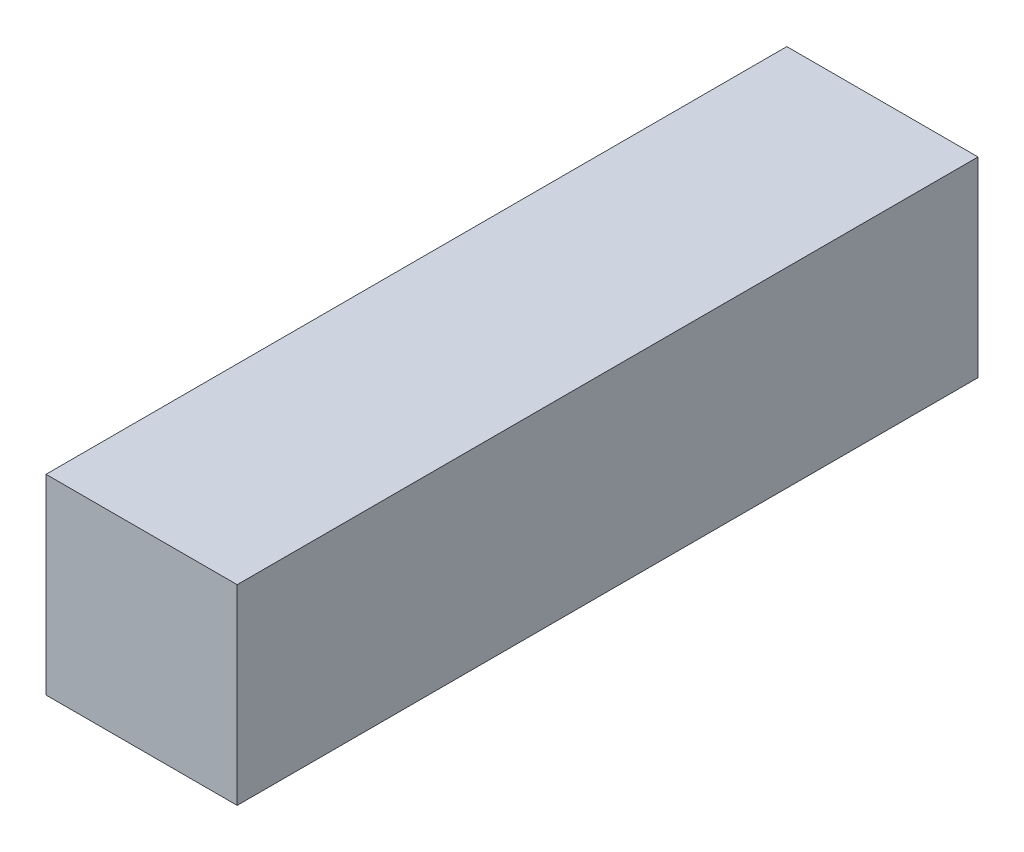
ISO-10303-21;
HEADER;
FILE_DESCRIPTION(('STEP AP214'),'2;1');
FILE_NAME('part.step','',(''),(''),'','','');
FILE_SCHEMA(('AUTOMOTIVE_DESIGN { 1 0 10303 214 1 1 1 1 }'));
ENDSEC;
DATA;
#1=APPLICATION_CONTEXT('core data for automotive mechanical design processes');
#2=APPLICATION_PROTOCOL_DEFINITION('international standard','automotive_design',2000,#1);
#3=PRODUCT_CONTEXT('',#1,'mechanical');
#4=PRODUCT('Part','Part','',(#3));
#5=PRODUCT_RELATED_PRODUCT_CATEGORY('part','',(#4));
#6=PRODUCT_DEFINITION_FORMATION('','',#4);
#7=PRODUCT_DEFINITION_CONTEXT('part definition',#1,'design');
#8=PRODUCT_DEFINITION('design','',#6,#7);
#9=PRODUCT_DEFINITION_SHAPE('','',#8);
#10=(LENGTH_UNIT() NAMED_UNIT(*) SI_UNIT(.MILLI.,.METRE.));
#11=(NAMED_UNIT(*) PLANE_ANGLE_UNIT() SI_UNIT($,.RADIAN.));
#12=(NAMED_UNIT(*) SI_UNIT($,.STERADIAN.) SOLID_ANGLE_UNIT());
#13=UNCERTAINTY_MEASURE_WITH_UNIT(LENGTH_MEASURE(1.E-05),#10,'distance_accuracy_value','');
#14=(GEOMETRIC_REPRESENTATION_CONTEXT(3) GLOBAL_UNCERTAINTY_ASSIGNED_CONTEXT((#13)) GLOBAL_UNIT_ASSIGNED_CONTEXT((#10,
#11,#12)) REPRESENTATION_CONTEXT('',''));
#15=CARTESIAN_POINT('',(0.,0.,0.));
#16=DIRECTION('',(0.,0.,1.));
#17=DIRECTION('',(1.,0.,0.));
#18=AXIS2_PLACEMENT_3D('',#15,#16,#17);
#19=CARTESIAN_POINT('',(-2.00000000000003,3.,-7.25));
#20=DIRECTION('',(1.,0.,0.));
#21=DIRECTION('',(0.,0.,-1.));
#22=AXIS2_PLACEMENT_3D('',#19,#20,#21);
#23=PLANE('',#22);
#24=DIRECTION('',(0.,0.,1.));
#25=VECTOR('',#24,1.);
#26=CARTESIAN_POINT('',(-2.00000000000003,0.,-7.25));
#27=LINE('',#26,#25);
#28=CARTESIAN_POINT('',(-2.00000000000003,0.,-7.25));
#29=VERTEX_POINT('',#28);
#30=CARTESIAN_POINT('',(-2.00000000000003,0.,8.25000000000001));
#31=VERTEX_POINT('',#30);
#32=EDGE_CURVE('E154',#29,#31,#27,.T.);
#33=ORIENTED_EDGE('',*,*,#32,.T.);
#34=DIRECTION('',(0.,-1.,0.));
#35=VECTOR('',#34,1.);
#36=CARTESIAN_POINT('',(-2.00000000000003,3.,8.25000000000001));
#37=LINE('',#36,#35);
#38=CARTESIAN_POINT('',(-2.00000000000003,4.,8.25000000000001));
#39=VERTEX_POINT('',#38);
#40=EDGE_CURVE('E168',#39,#31,#37,.T.);
#41=ORIENTED_EDGE('',*,*,#40,.F.);
#42=DIRECTION('',(0.,0.,1.));
#43=VECTOR('',#42,1.);
#44=CARTESIAN_POINT('',(-2.00000000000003,4.,8.25000000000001));
#45=LINE('',#44,#43);
#46=CARTESIAN_POINT('',(-2.00000000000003,4.,-7.25));
#47=VERTEX_POINT('',#46);
#48=EDGE_CURVE('E137',#47,#39,#45,.T.);
#49=ORIENTED_EDGE('',*,*,#48,.F.);
#50=DIRECTION('',(0.,-1.,0.));
#51=VECTOR('',#50,1.);
#52=CARTESIAN_POINT('',(-2.00000000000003,3.,-7.25));
#53=LINE('',#52,#51);
#54=EDGE_CURVE('E171',#47,#29,#53,.T.);
#55=ORIENTED_EDGE('',*,*,#54,.T.);
#56=EDGE_LOOP('',(#33,#41,#49,#55));
#57=FACE_BOUND('',#56,.T.);
#58=ADVANCED_FACE('F33',(#57),#23,.F.);
#59=CARTESIAN_POINT('',(2.00000000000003,3.,8.25000000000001));
#60=DIRECTION('',(0.,0.,-1.));
#61=DIRECTION('',(-1.,0.,0.));
#62=AXIS2_PLACEMENT_3D('',#59,#60,#61);
#63=PLANE('',#62);
#64=DIRECTION('',(1.,0.,0.));
#65=VECTOR('',#64,1.);
#66=CARTESIAN_POINT('',(2.00000000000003,0.,8.25000000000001));
#67=LINE('',#66,#65);
#68=CARTESIAN_POINT('',(2.00000000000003,0.,8.25000000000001));
#69=VERTEX_POINT('',#68);
#70=EDGE_CURVE('E157',#31,#69,#67,.T.);
#71=ORIENTED_EDGE('',*,*,#70,.T.);
#72=DIRECTION('',(0.,-1.,0.));
#73=VECTOR('',#72,1.);
#74=CARTESIAN_POINT('',(2.00000000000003,3.,8.25000000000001));
#75=LINE('',#74,#73);
#76=CARTESIAN_POINT('',(2.00000000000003,4.,8.25000000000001));
#77=VERTEX_POINT('',#76);
#78=EDGE_CURVE('E166',#77,#69,#75,.T.);
#79=ORIENTED_EDGE('',*,*,#78,.F.);
#80=DIRECTION('',(1.,0.,0.));
#81=VECTOR('',#80,1.);
#82=CARTESIAN_POINT('',(2.00000000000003,4.,8.25000000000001));
#83=LINE('',#82,#81);
#84=EDGE_CURVE('E140',#39,#77,#83,.T.);
#85=ORIENTED_EDGE('',*,*,#84,.F.);
#86=ORIENTED_EDGE('',*,*,#40,.T.);
#87=EDGE_LOOP('',(#71,#79,#85,#86));
#88=FACE_BOUND('',#87,.T.);
#89=ADVANCED_FACE('F194',(#88),#63,.F.);
#90=CARTESIAN_POINT('',(2.00000000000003,3.,7.25));
#91=DIRECTION('',(-1.,0.,0.));
#92=DIRECTION('',(0.,0.,1.));
#93=AXIS2_PLACEMENT_3D('',#90,#91,#92);
#94=PLANE('',#93);
#95=DIRECTION('',(0.,0.,-1.));
#96=VECTOR('',#95,1.);
#97=CARTESIAN_POINT('',(2.00000000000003,0.,7.25));
#98=LINE('',#97,#96);
#99=CARTESIAN_POINT('',(2.00000000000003,0.,-7.25));
#100=VERTEX_POINT('',#99);
#101=EDGE_CURVE('E55',#69,#100,#98,.T.);
#102=ORIENTED_EDGE('',*,*,#101,.T.);
#103=DIRECTION('',(0.,-1.,0.));
#104=VECTOR('',#103,1.);
#105=CARTESIAN_POINT('',(2.00000000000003,3.,-7.25));
#106=LINE('',#105,#104);
#107=CARTESIAN_POINT('',(2.00000000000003,4.,-7.25));
#108=VERTEX_POINT('',#107);
#109=EDGE_CURVE('E164',#108,#100,#106,.T.);
#110=ORIENTED_EDGE('',*,*,#109,.F.);
#111=DIRECTION('',(0.,0.,-1.));
#112=VECTOR('',#111,1.);
#113=CARTESIAN_POINT('',(2.00000000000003,4.,-7.25));
#114=LINE('',#113,#112);
#115=EDGE_CURVE('E143',#77,#108,#114,.T.);
#116=ORIENTED_EDGE('',*,*,#115,.F.);
#117=ORIENTED_EDGE('',*,*,#78,.T.);
#118=EDGE_LOOP('',(#102,#110,#116,#117));
#119=FACE_BOUND('',#118,.T.);
#120=ADVANCED_FACE('F199',(#119),#94,.F.);
#121=CARTESIAN_POINT('',(1.00000000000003,3.,-7.25));
#122=DIRECTION('',(0.,0.,1.));
#123=DIRECTION('',(1.,0.,0.));
#124=AXIS2_PLACEMENT_3D('',#121,#122,#123);
#125=PLANE('',#124);
#126=DIRECTION('',(-1.,0.,0.));
#127=VECTOR('',#126,1.);
#128=CARTESIAN_POINT('',(-2.00000000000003,3.,-7.25));
#129=LINE('',#128,#127);
#130=CARTESIAN_POINT('',(1.58749999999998,2.99999999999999,-7.25));
#131=VERTEX_POINT('',#130);
#132=CARTESIAN_POINT('',(-1.5875,2.99999999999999,-7.25));
#133=VERTEX_POINT('',#132);
#134=EDGE_CURVE('E111',#131,#133,#129,.T.);
#135=ORIENTED_EDGE('',*,*,#134,.T.);
#136=DIRECTION('',(0.,-1.,0.));
#137=VECTOR('',#136,1.);
#138=CARTESIAN_POINT('',(-1.58750000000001,3.,-7.25));
#139=LINE('',#138,#137);
#140=CARTESIAN_POINT('',(-1.58750000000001,0.,-7.25));
#141=VERTEX_POINT('',#140);
#142=EDGE_CURVE('E131',#133,#141,#139,.T.);
#143=ORIENTED_EDGE('',*,*,#142,.T.);
#144=DIRECTION('',(-1.,0.,0.));
#145=VECTOR('',#144,1.);
#146=CARTESIAN_POINT('',(-2.00000000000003,0.,-7.25));
#147=LINE('',#146,#145);
#148=EDGE_CURVE('E149',#141,#29,#147,.T.);
#149=ORIENTED_EDGE('',*,*,#148,.T.);
#150=ORIENTED_EDGE('',*,*,#54,.F.);
#151=DIRECTION('',(-1.,0.,0.));
#152=VECTOR('',#151,1.);
#153=CARTESIAN_POINT('',(-2.00000000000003,4.,-7.25));
#154=LINE('',#153,#152);
#155=EDGE_CURVE('E146',#108,#47,#154,.T.);
#156=ORIENTED_EDGE('',*,*,#155,.F.);
#157=ORIENTED_EDGE('',*,*,#109,.T.);
#158=DIRECTION('',(-1.,0.,0.));
#159=VECTOR('',#158,1.);
#160=CARTESIAN_POINT('',(1.00000000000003,0.,-7.25));
#161=LINE('',#160,#159);
#162=CARTESIAN_POINT('',(1.58749999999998,0.,-7.25));
#163=VERTEX_POINT('',#162);
#164=EDGE_CURVE('E161',#100,#163,#161,.T.);
#165=ORIENTED_EDGE('',*,*,#164,.T.);
#166=DIRECTION('',(0.,1.,0.));
#167=VECTOR('',#166,1.);
#168=CARTESIAN_POINT('',(1.58749999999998,3.,-7.25));
#169=LINE('',#168,#167);
#170=EDGE_CURVE('E135',#163,#131,#169,.T.);
#171=ORIENTED_EDGE('',*,*,#170,.T.);
#172=EDGE_LOOP('',(#135,#143,#149,#150,#156,#157,#165,#171));
#173=FACE_BOUND('',#172,.T.);
#174=ADVANCED_FACE('F188',(#173),#125,.F.);
#175=CARTESIAN_POINT('',(-0.99999999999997,0.,7.25000000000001));
#176=DIRECTION('',(0.,1.,0.));
#177=DIRECTION('',(0.,0.,1.));
#178=AXIS2_PLACEMENT_3D('',#175,#176,#177);
#179=PLANE('',#178);
#180=DIRECTION('',(-0.0290774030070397,0.,-0.999577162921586));
#181=VECTOR('',#180,1.);
#182=CARTESIAN_POINT('',(1.5717330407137,0.,7.17518904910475));
#183=LINE('',#182,#181);
#184=CARTESIAN_POINT('',(1.58822769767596,0.,7.74221638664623));
#185=VERTEX_POINT('',#184);
#186=CARTESIAN_POINT('',(1.5875,0.,7.71720074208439));
#187=VERTEX_POINT('',#186);
#188=EDGE_CURVE('E40',#185,#187,#183,.T.);
#189=ORIENTED_EDGE('',*,*,#188,.T.);
#190=DIRECTION('',(0.,0.,-1.));
#191=VECTOR('',#190,1.);
#192=CARTESIAN_POINT('',(1.58749999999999,0.,7.25));
#193=LINE('',#192,#191);
#194=EDGE_CURVE('E11',#187,#163,#193,.T.);
#195=ORIENTED_EDGE('',*,*,#194,.T.);
#196=ORIENTED_EDGE('',*,*,#164,.F.);
#197=ORIENTED_EDGE('',*,*,#101,.F.);
#198=ORIENTED_EDGE('',*,*,#70,.F.);
#199=ORIENTED_EDGE('',*,*,#32,.F.);
#200=ORIENTED_EDGE('',*,*,#148,.F.);
#201=DIRECTION('',(0.,0.,1.));
#202=VECTOR('',#201,1.);
#203=CARTESIAN_POINT('',(-1.5875,0.,7.25000000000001));
#204=LINE('',#203,#202);
#205=CARTESIAN_POINT('',(-1.5875,0.,7.74221638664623));
#206=VERTEX_POINT('',#205);
#207=EDGE_CURVE('E174',#141,#206,#204,.T.);
#208=ORIENTED_EDGE('',*,*,#207,.T.);
#209=DIRECTION('',(1.,0.,0.));
#210=VECTOR('',#209,1.);
#211=CARTESIAN_POINT('',(-0.999999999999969,0.,7.74221638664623));
#212=LINE('',#211,#210);
#213=EDGE_CURVE('E177',#206,#185,#212,.T.);
#214=ORIENTED_EDGE('',*,*,#213,.T.);
#215=EDGE_LOOP('',(#189,#195,#196,#197,#198,#199,#200,#208,#214));
#216=FACE_BOUND('',#215,.T.);
#217=ADVANCED_FACE('F180',(#216),#179,.F.);
#218=CARTESIAN_POINT('',(-2.00000000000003,4.,-7.25));
#219=DIRECTION('',(0.,-1.,0.));
#220=DIRECTION('',(0.,0.,-1.));
#221=AXIS2_PLACEMENT_3D('',#218,#219,#220);
#222=PLANE('',#221);
#223=ORIENTED_EDGE('',*,*,#48,.T.);
#224=ORIENTED_EDGE('',*,*,#84,.T.);
#225=ORIENTED_EDGE('',*,*,#115,.T.);
#226=ORIENTED_EDGE('',*,*,#155,.T.);
#227=EDGE_LOOP('',(#223,#224,#225,#226));
#228=FACE_BOUND('',#227,.T.);
#229=ADVANCED_FACE('F197',(#228),#222,.F.);
#230=CARTESIAN_POINT('',(-2.00000000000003,3.,-7.25));
#231=DIRECTION('',(0.,-1.,0.));
#232=DIRECTION('',(0.,0.,-1.));
#233=AXIS2_PLACEMENT_3D('',#230,#231,#232);
#234=PLANE('',#233);
#235=DIRECTION('',(0.,0.,-1.));
#236=VECTOR('',#235,1.);
#237=CARTESIAN_POINT('',(-1.5875,2.99999999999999,7.71720074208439));
#238=LINE('',#237,#236);
#239=CARTESIAN_POINT('',(-1.5875,2.99999999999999,7.74221638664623));
#240=VERTEX_POINT('',#239);
#241=EDGE_CURVE('E114',#240,#133,#238,.T.);
#242=ORIENTED_EDGE('',*,*,#241,.T.);
#243=ORIENTED_EDGE('',*,*,#134,.F.);
#244=DIRECTION('',(0.,0.,1.));
#245=VECTOR('',#244,1.);
#246=CARTESIAN_POINT('',(1.5875,2.99999999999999,7.71720074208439));
#247=LINE('',#246,#245);
#248=CARTESIAN_POINT('',(1.5875,2.99999999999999,7.71720074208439));
#249=VERTEX_POINT('',#248);
#250=EDGE_CURVE('E103',#131,#249,#247,.T.);
#251=ORIENTED_EDGE('',*,*,#250,.T.);
#252=DIRECTION('',(0.0290774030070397,0.,0.999577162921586));
#253=VECTOR('',#252,1.);
#254=CARTESIAN_POINT('',(1.58822769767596,2.99999999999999,7.74221638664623));
#255=LINE('',#254,#253);
#256=CARTESIAN_POINT('',(1.58822769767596,2.99999999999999,7.74221638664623));
#257=VERTEX_POINT('',#256);
#258=EDGE_CURVE('E109',#249,#257,#255,.T.);
#259=ORIENTED_EDGE('',*,*,#258,.T.);
#260=DIRECTION('',(-1.,0.,0.));
#261=VECTOR('',#260,1.);
#262=CARTESIAN_POINT('',(1.58822769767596,2.99999999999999,7.74221638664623));
#263=LINE('',#262,#261);
#264=EDGE_CURVE('E122',#257,#240,#263,.T.);
#265=ORIENTED_EDGE('',*,*,#264,.T.);
#266=EDGE_LOOP('',(#242,#243,#251,#259,#265));
#267=FACE_BOUND('',#266,.T.);
#268=ADVANCED_FACE('F106',(#267),#234,.T.);
#269=CARTESIAN_POINT('',(1.58822769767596,2.99999999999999,7.74221638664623));
#270=DIRECTION('',(0.,0.,1.));
#271=DIRECTION('',(1.,0.,0.));
#272=AXIS2_PLACEMENT_3D('',#269,#270,#271);
#273=PLANE('',#272);
#274=DIRECTION('',(0.,-1.,0.));
#275=VECTOR('',#274,1.);
#276=CARTESIAN_POINT('',(-1.5875,2.99999999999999,7.74221638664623));
#277=LINE('',#276,#275);
#278=EDGE_CURVE('E47',#240,#206,#277,.T.);
#279=ORIENTED_EDGE('',*,*,#278,.F.);
#280=ORIENTED_EDGE('',*,*,#264,.F.);
#281=DIRECTION('',(0.,-1.,0.));
#282=VECTOR('',#281,1.);
#283=CARTESIAN_POINT('',(1.58822769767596,2.99999999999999,7.74221638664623));
#284=LINE('',#283,#282);
#285=EDGE_CURVE('E121',#257,#185,#284,.T.);
#286=ORIENTED_EDGE('',*,*,#285,.T.);
#287=ORIENTED_EDGE('',*,*,#213,.F.);
#288=EDGE_LOOP('',(#279,#280,#286,#287));
#289=FACE_BOUND('',#288,.T.);
#290=ADVANCED_FACE('F183',(#289),#273,.F.);
#291=CARTESIAN_POINT('',(1.58822769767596,2.99999999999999,7.74221638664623));
#292=DIRECTION('',(0.999577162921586,0.,-0.0290774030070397));
#293=DIRECTION('',(-0.0290774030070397,0.,-0.999577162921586));
#294=AXIS2_PLACEMENT_3D('',#291,#292,#293);
#295=PLANE('',#294);
#296=ORIENTED_EDGE('',*,*,#285,.F.);
#297=ORIENTED_EDGE('',*,*,#258,.F.);
#298=DIRECTION('',(0.,-1.,0.));
#299=VECTOR('',#298,1.);
#300=CARTESIAN_POINT('',(1.5875,2.99999999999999,7.71720074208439));
#301=LINE('',#300,#299);
#302=EDGE_CURVE('E117',#249,#187,#301,.T.);
#303=ORIENTED_EDGE('',*,*,#302,.T.);
#304=ORIENTED_EDGE('',*,*,#188,.F.);
#305=EDGE_LOOP('',(#296,#297,#303,#304));
#306=FACE_BOUND('',#305,.T.);
#307=ADVANCED_FACE('F124',(#306),#295,.F.);
#308=CARTESIAN_POINT('',(1.5875,2.99999999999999,7.71720074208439));
#309=DIRECTION('',(1.,0.,0.));
#310=DIRECTION('',(0.,0.,-1.));
#311=AXIS2_PLACEMENT_3D('',#308,#309,#310);
#312=PLANE('',#311);
#313=ORIENTED_EDGE('',*,*,#194,.F.);
#314=ORIENTED_EDGE('',*,*,#302,.F.);
#315=ORIENTED_EDGE('',*,*,#250,.F.);
#316=ORIENTED_EDGE('',*,*,#170,.F.);
#317=EDGE_LOOP('',(#313,#314,#315,#316));
#318=FACE_BOUND('',#317,.T.);
#319=ADVANCED_FACE('F118',(#318),#312,.F.);
#320=CARTESIAN_POINT('',(-1.5875,2.99999999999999,7.71720074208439));
#321=DIRECTION('',(-1.,0.,0.));
#322=DIRECTION('',(0.,0.,1.));
#323=AXIS2_PLACEMENT_3D('',#320,#321,#322);
#324=PLANE('',#323);
#325=ORIENTED_EDGE('',*,*,#241,.F.);
#326=ORIENTED_EDGE('',*,*,#278,.T.);
#327=ORIENTED_EDGE('',*,*,#207,.F.);
#328=ORIENTED_EDGE('',*,*,#142,.F.);
#329=EDGE_LOOP('',(#325,#326,#327,#328));
#330=FACE_BOUND('',#329,.T.);
#331=ADVANCED_FACE('F185',(#330),#324,.F.);
#332=CLOSED_SHELL('',(#58,#89,#120,#174,#217,#229,#268,#290,#307,#319,#331));
#333=MANIFOLD_SOLID_BREP('B2',#332);
#334=ADVANCED_BREP_SHAPE_REPRESENTATION('',(#18,#333),#14);
#335=SHAPE_DEFINITION_REPRESENTATION(#9,#334);
ENDSEC;
END-ISO-10303-21;
